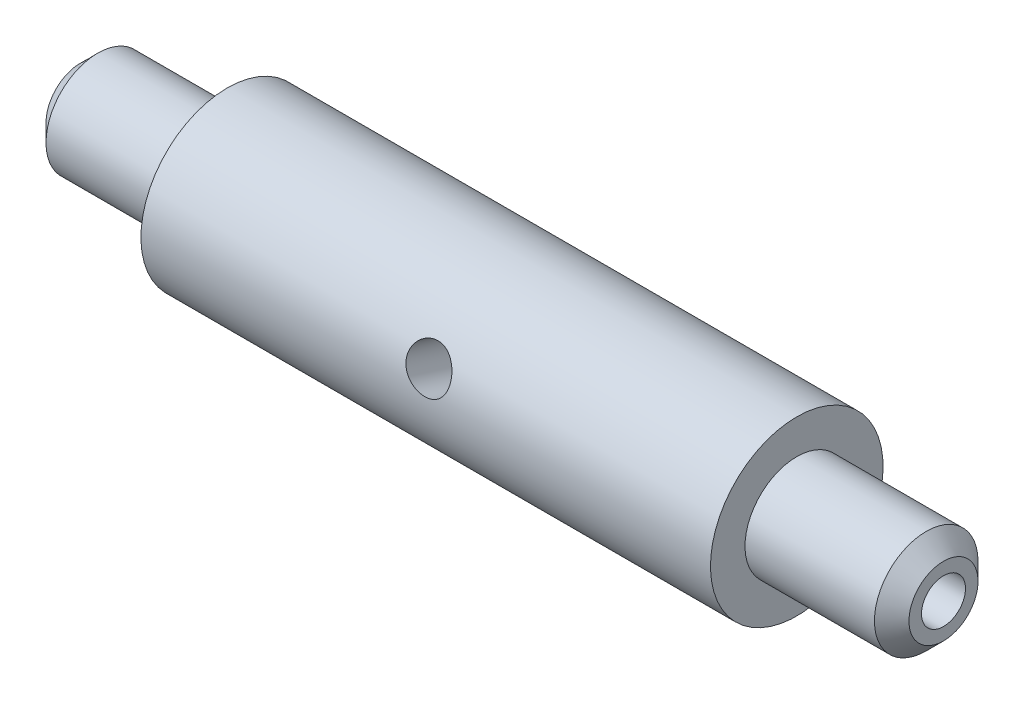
ISO-10303-21;
HEADER;
FILE_DESCRIPTION(('STEP AP214'),'2;1');
FILE_NAME('part.step','',(''),(''),'','','');
FILE_SCHEMA(('AUTOMOTIVE_DESIGN { 1 0 10303 214 1 1 1 1 }'));
ENDSEC;
DATA;
#1=APPLICATION_CONTEXT('core data for automotive mechanical design processes');
#2=APPLICATION_PROTOCOL_DEFINITION('international standard','automotive_design',2000,#1);
#3=PRODUCT_CONTEXT('',#1,'mechanical');
#4=PRODUCT('Part','Part','',(#3));
#5=PRODUCT_RELATED_PRODUCT_CATEGORY('part','',(#4));
#6=PRODUCT_DEFINITION_FORMATION('','',#4);
#7=PRODUCT_DEFINITION_CONTEXT('part definition',#1,'design');
#8=PRODUCT_DEFINITION('design','',#6,#7);
#9=PRODUCT_DEFINITION_SHAPE('','',#8);
#10=(LENGTH_UNIT() NAMED_UNIT(*) SI_UNIT(.MILLI.,.METRE.));
#11=(NAMED_UNIT(*) PLANE_ANGLE_UNIT() SI_UNIT($,.RADIAN.));
#12=(NAMED_UNIT(*) SI_UNIT($,.STERADIAN.) SOLID_ANGLE_UNIT());
#13=UNCERTAINTY_MEASURE_WITH_UNIT(LENGTH_MEASURE(1.E-05),#10,'distance_accuracy_value','');
#14=(GEOMETRIC_REPRESENTATION_CONTEXT(3) GLOBAL_UNCERTAINTY_ASSIGNED_CONTEXT((#13)) GLOBAL_UNIT_ASSIGNED_CONTEXT((#10,
#11,#12)) REPRESENTATION_CONTEXT('',''));
#15=CARTESIAN_POINT('',(0.,0.,0.));
#16=DIRECTION('',(0.,0.,1.));
#17=DIRECTION('',(1.,0.,0.));
#18=AXIS2_PLACEMENT_3D('',#15,#16,#17);
#19=CARTESIAN_POINT('',(-8.20003221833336,0.,0.));
#20=DIRECTION('',(1.,0.,0.));
#21=DIRECTION('',(0.,0.,-0.999999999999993));
#22=AXIS2_PLACEMENT_3D('',#19,#20,#21);
#23=CONICAL_SURFACE('',#22,2.54999999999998,1.02974425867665);
#24=CARTESIAN_POINT('',(-8.20003221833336,0.,0.));
#25=DIRECTION('',(1.,0.,0.));
#26=DIRECTION('',(0.,0.,-0.999999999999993));
#27=AXIS2_PLACEMENT_3D('',#24,#25,#26);
#28=CIRCLE('',#27,2.54999999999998);
#29=CARTESIAN_POINT('',(-8.2000322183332,1.37034319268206,-2.15050215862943));
#30=VERTEX_POINT('',#29);
#31=CARTESIAN_POINT('',(-8.20003221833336,2.35173390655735,0.985823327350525));
#32=VERTEX_POINT('',#31);
#33=EDGE_CURVE('E111',#30,#32,#28,.T.);
#34=ORIENTED_EDGE('',*,*,#33,.T.);
#35=CARTESIAN_POINT('',(-8.04661276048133,2.36722979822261,1.50536225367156));
#36=CARTESIAN_POINT('',(-8.06575716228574,2.36812167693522,1.44457380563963));
#37=CARTESIAN_POINT('',(-8.08458511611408,2.3680211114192,1.38367703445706));
#38=CARTESIAN_POINT('',(-8.12145272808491,2.36591071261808,1.26167566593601));
#39=CARTESIAN_POINT('',(-8.13949235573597,2.36390080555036,1.20057106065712));
#40=CARTESIAN_POINT('',(-8.19223024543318,2.35511439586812,1.01683755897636));
#41=CARTESIAN_POINT('',(-8.22550674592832,2.34557964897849,0.89391638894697));
#42=CARTESIAN_POINT('',(-8.2867348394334,2.31957752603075,0.647797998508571));
#43=CARTESIAN_POINT('',(-8.3146991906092,2.30312707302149,0.524602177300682));
#44=CARTESIAN_POINT('',(-8.36378969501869,2.26351269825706,0.277945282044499));
#45=CARTESIAN_POINT('',(-8.38491835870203,2.24035124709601,0.154484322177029));
#46=CARTESIAN_POINT('',(-8.41838591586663,2.18806767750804,-0.0893980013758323));
#47=CARTESIAN_POINT('',(-8.43091420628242,2.15909347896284,-0.209824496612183));
#48=CARTESIAN_POINT('',(-8.44685139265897,2.09506375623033,-0.449666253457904));
#49=CARTESIAN_POINT('',(-8.45026117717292,2.06000882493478,-0.569081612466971));
#50=CARTESIAN_POINT('',(-8.44763378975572,1.9840921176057,-0.805949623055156));
#51=CARTESIAN_POINT('',(-8.44159611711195,1.94323003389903,-0.923402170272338));
#52=CARTESIAN_POINT('',(-8.42064540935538,1.85602225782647,-1.15543916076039));
#53=CARTESIAN_POINT('',(-8.40573130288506,1.80967590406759,-1.27002325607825));
#54=CARTESIAN_POINT('',(-8.36913215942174,1.7140237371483,-1.49044784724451));
#55=CARTESIAN_POINT('',(-8.34778964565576,1.66495168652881,-1.59644819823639));
#56=CARTESIAN_POINT('',(-8.29946047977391,1.56216183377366,-1.80485139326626));
#57=CARTESIAN_POINT('',(-8.27247290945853,1.50844327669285,-1.90725364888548));
#58=CARTESIAN_POINT('',(-8.2141220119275,1.39628564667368,-2.10826347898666));
#59=CARTESIAN_POINT('',(-8.18275487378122,1.3378424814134,-2.20686765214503));
#60=CARTESIAN_POINT('',(-8.11681241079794,1.21609595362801,-2.39979898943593));
#61=CARTESIAN_POINT('',(-8.08223964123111,1.15279646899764,-2.49412947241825));
#62=CARTESIAN_POINT('',(-8.04661276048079,1.08693261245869,-2.58620763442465));
#63=B_SPLINE_CURVE_WITH_KNOTS('',3,(#35,#36,#37,#38,#39,#40,#41,#42,#43,#44,#45,#46,#47,#48,#49,
#50,#51,#52,#53,#54,#55,#56,#57,#58,#59,#60,#61,#62),.UNSPECIFIED.,.F.,.F.,(4,2,2,2,2,2,2,2,2,2,
2,2,2,4),(0.,0.191194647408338,0.382396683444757,0.765201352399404,1.14707468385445,
1.52880761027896,1.9018383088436,2.27483265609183,2.64784677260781,3.02090591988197,
3.37682715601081,3.73280632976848,4.08909721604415,4.44510649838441),.UNSPECIFIED.);
#64=EDGE_CURVE('E67',#32,#30,#63,.T.);
#65=ORIENTED_EDGE('',*,*,#64,.T.);
#66=EDGE_LOOP('',(#34,#65));
#67=FACE_BOUND('',#66,.T.);
#68=ADVANCED_FACE('F52',(#67),#23,.F.);
#69=CARTESIAN_POINT('',(40.2677732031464,0.,0.));
#70=DIRECTION('',(-1.,0.,0.));
#71=DIRECTION('',(0.,-0.999999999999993,0.));
#72=AXIS2_PLACEMENT_3D('',#69,#70,#71);
#73=PLANE('',#72);
#74=CARTESIAN_POINT('',(40.2677732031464,0.,0.));
#75=DIRECTION('',(1.,0.,0.));
#76=DIRECTION('',(0.,0.,-0.999999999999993));
#77=AXIS2_PLACEMENT_3D('',#74,#75,#76);
#78=CIRCLE('',#77,2.54999999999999);
#79=CARTESIAN_POINT('',(40.2677732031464,0.,-2.54999999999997));
#80=VERTEX_POINT('',#79);
#81=EDGE_CURVE('E115',#80,#80,#78,.T.);
#82=ORIENTED_EDGE('',*,*,#81,.F.);
#83=EDGE_LOOP('',(#82));
#84=FACE_BOUND('',#83,.T.);
#85=CARTESIAN_POINT('',(40.2677732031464,0.,0.));
#86=DIRECTION('',(-1.,0.,0.));
#87=DIRECTION('',(0.,-0.999999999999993,0.));
#88=AXIS2_PLACEMENT_3D('',#85,#86,#87);
#89=CIRCLE('',#88,4.00000000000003);
#90=CARTESIAN_POINT('',(40.2677732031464,-3.99999999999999,0.));
#91=VERTEX_POINT('',#90);
#92=EDGE_CURVE('E200',#91,#91,#89,.F.);
#93=ORIENTED_EDGE('',*,*,#92,.T.);
#94=EDGE_LOOP('',(#93));
#95=FACE_BOUND('',#94,.T.);
#96=ADVANCED_FACE('F172',(#84,#95),#73,.F.);
#97=CARTESIAN_POINT('',(3.28903571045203E-12,0.,0.));
#98=DIRECTION('',(1.,0.,0.));
#99=DIRECTION('',(0.,0.999999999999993,0.));
#100=AXIS2_PLACEMENT_3D('',#97,#98,#99);
#101=CYLINDRICAL_SURFACE('',#100,6.);
#102=CARTESIAN_POINT('',(38.2677732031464,0.,0.));
#103=DIRECTION('',(-1.,0.,0.));
#104=DIRECTION('',(0.,-0.999999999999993,0.));
#105=AXIS2_PLACEMENT_3D('',#102,#103,#104);
#106=CIRCLE('',#105,6.);
#107=CARTESIAN_POINT('',(38.2677732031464,-5.99999999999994,0.));
#108=VERTEX_POINT('',#107);
#109=EDGE_CURVE('E202',#108,#108,#106,.T.);
#110=ORIENTED_EDGE('',*,*,#109,.T.);
#111=EDGE_LOOP('',(#110));
#112=FACE_BOUND('',#111,.T.);
#113=CARTESIAN_POINT('',(23.2677732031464,0.,0.));
#114=DIRECTION('',(1.,0.,0.));
#115=DIRECTION('',(0.,0.999999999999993,0.));
#116=AXIS2_PLACEMENT_3D('',#113,#114,#115);
#117=CIRCLE('',#116,6.);
#118=CARTESIAN_POINT('',(23.2677732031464,5.99999999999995,0.));
#119=VERTEX_POINT('',#118);
#120=EDGE_CURVE('E191',#119,#119,#117,.T.);
#121=ORIENTED_EDGE('',*,*,#120,.T.);
#122=EDGE_LOOP('',(#121));
#123=FACE_BOUND('',#122,.T.);
#124=ADVANCED_FACE('F177',(#112,#123),#101,.T.);
#125=CARTESIAN_POINT('',(23.2677732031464,0.,0.));
#126=DIRECTION('',(1.,0.,0.));
#127=DIRECTION('',(0.,0.999999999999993,0.));
#128=AXIS2_PLACEMENT_3D('',#125,#126,#127);
#129=PLANE('',#128);
#130=CARTESIAN_POINT('',(23.2677732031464,0.,0.));
#131=DIRECTION('',(1.,0.,0.));
#132=DIRECTION('',(0.,0.999999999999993,0.));
#133=AXIS2_PLACEMENT_3D('',#130,#131,#132);
#134=CIRCLE('',#133,10.);
#135=CARTESIAN_POINT('',(23.2677732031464,9.99999999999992,0.));
#136=VERTEX_POINT('',#135);
#137=EDGE_CURVE('E188',#136,#136,#134,.T.);
#138=ORIENTED_EDGE('',*,*,#137,.T.);
#139=EDGE_LOOP('',(#138));
#140=FACE_BOUND('',#139,.T.);
#141=ORIENTED_EDGE('',*,*,#120,.F.);
#142=EDGE_LOOP('',(#141));
#143=FACE_BOUND('',#142,.T.);
#144=ADVANCED_FACE('F167',(#140,#143),#129,.T.);
#145=CARTESIAN_POINT('',(3.28903571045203E-12,0.,0.));
#146=DIRECTION('',(1.,0.,0.));
#147=DIRECTION('',(0.,0.999999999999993,0.));
#148=AXIS2_PLACEMENT_3D('',#145,#146,#147);
#149=CYLINDRICAL_SURFACE('',#148,10.);
#150=CARTESIAN_POINT('',(-9.84317442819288,0.453959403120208,9.98969072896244));
#151=CARTESIAN_POINT('',(-9.9838873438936,0.45396384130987,9.98969209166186));
#152=CARTESIAN_POINT('',(-10.1246420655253,0.466040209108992,9.98916409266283));
#153=CARTESIAN_POINT('',(-10.4021027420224,0.513866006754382,9.98681607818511));
#154=CARTESIAN_POINT('',(-10.5388063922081,0.549628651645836,9.98499534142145));
#155=CARTESIAN_POINT('',(-10.8041113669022,0.643359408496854,9.9793924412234));
#156=CARTESIAN_POINT('',(-10.9327231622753,0.701298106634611,9.97561287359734));
#157=CARTESIAN_POINT('',(-11.1786711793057,0.837304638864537,9.96511684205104));
#158=CARTESIAN_POINT('',(-11.2960068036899,0.915373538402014,9.9584002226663));
#159=CARTESIAN_POINT('',(-11.5187572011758,1.09091398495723,9.94071565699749));
#160=CARTESIAN_POINT('',(-11.6238757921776,1.18875288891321,9.92966278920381));
#161=CARTESIAN_POINT('',(-11.8165962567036,1.39973951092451,9.90212248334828));
#162=CARTESIAN_POINT('',(-11.904196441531,1.51288870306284,9.88563452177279));
#163=CARTESIAN_POINT('',(-12.0606120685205,1.75286790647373,9.84593500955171));
#164=CARTESIAN_POINT('',(-12.1291355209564,1.87987308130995,9.82262908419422));
#165=CARTESIAN_POINT('',(-12.2435523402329,2.14226448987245,9.76875701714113));
#166=CARTESIAN_POINT('',(-12.2894491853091,2.27764943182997,9.73819199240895));
#167=CARTESIAN_POINT('',(-12.3563583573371,2.54966545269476,9.67049266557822));
#168=CARTESIAN_POINT('',(-12.3778739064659,2.68621038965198,9.63351010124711));
#169=CARTESIAN_POINT('',(-12.3969903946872,2.9591032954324,9.55321534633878));
#170=CARTESIAN_POINT('',(-12.394595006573,3.09545129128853,9.50990412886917));
#171=CARTESIAN_POINT('',(-12.3663173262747,3.36078740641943,9.41935871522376));
#172=CARTESIAN_POINT('',(-12.3409783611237,3.48987275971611,9.37223812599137));
#173=CARTESIAN_POINT('',(-12.2684074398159,3.74054996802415,9.27504015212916));
#174=CARTESIAN_POINT('',(-12.2211742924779,3.86214141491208,9.22496260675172));
#175=CARTESIAN_POINT('',(-12.1057230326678,4.0959585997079,9.12356991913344));
#176=CARTESIAN_POINT('',(-12.0373136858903,4.20808662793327,9.07224759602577));
#177=CARTESIAN_POINT('',(-11.8815974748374,4.4192228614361,8.97129781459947));
#178=CARTESIAN_POINT('',(-11.7942872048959,4.51822869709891,8.92167066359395));
#179=CARTESIAN_POINT('',(-11.600343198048,4.7036543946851,8.82535391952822));
#180=CARTESIAN_POINT('',(-11.4932349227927,4.78964179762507,8.77878625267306));
#181=CARTESIAN_POINT('',(-11.2642487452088,4.94375529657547,8.6929332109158));
#182=CARTESIAN_POINT('',(-11.1423700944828,5.0118804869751,8.65364820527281));
#183=CARTESIAN_POINT('',(-10.886394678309,5.12904549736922,8.58472818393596));
#184=CARTESIAN_POINT('',(-10.7522374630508,5.17798384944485,8.55514460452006));
#185=CARTESIAN_POINT('',(-10.4760579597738,5.25502783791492,8.50803995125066));
#186=CARTESIAN_POINT('',(-10.3340374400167,5.28313813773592,8.49051617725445));
#187=CARTESIAN_POINT('',(-10.0503383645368,5.31729436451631,8.46916633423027));
#188=CARTESIAN_POINT('',(-9.90875732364,5.32392447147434,8.46497765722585));
#189=CARTESIAN_POINT('',(-9.62635270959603,5.31658639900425,8.46958842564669));
#190=CARTESIAN_POINT('',(-9.48552906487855,5.30262020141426,8.47838662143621));
#191=CARTESIAN_POINT('',(-9.21113619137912,5.25488843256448,8.50804950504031));
#192=CARTESIAN_POINT('',(-9.07748388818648,5.22146720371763,8.5287042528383));
#193=CARTESIAN_POINT('',(-8.81845806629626,5.13591702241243,8.58049187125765));
#194=CARTESIAN_POINT('',(-8.69308556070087,5.08378578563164,8.6116260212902));
#195=CARTESIAN_POINT('',(-8.45136753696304,4.96072824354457,8.68310552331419));
#196=CARTESIAN_POINT('',(-8.33525720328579,4.88944155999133,8.7236251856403));
#197=CARTESIAN_POINT('',(-8.11788697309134,4.73009172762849,8.81104274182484));
#198=CARTESIAN_POINT('',(-8.0166296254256,4.64202570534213,8.85794172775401));
#199=CARTESIAN_POINT('',(-7.82912303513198,4.4484039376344,8.95677397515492));
#200=CARTESIAN_POINT('',(-7.74333548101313,4.34245106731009,9.00880681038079));
#201=CARTESIAN_POINT('',(-7.59256589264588,4.11712955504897,9.11398259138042));
#202=CARTESIAN_POINT('',(-7.52758276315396,3.99776161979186,9.16712547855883));
#203=CARTESIAN_POINT('',(-7.42084146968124,3.74945363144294,9.27143892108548));
#204=CARTESIAN_POINT('',(-7.37891400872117,3.62059145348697,9.32262121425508));
#205=CARTESIAN_POINT('',(-7.31897058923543,3.3560094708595,9.42109878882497));
#206=CARTESIAN_POINT('',(-7.30094981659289,3.22029105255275,9.468394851));
#207=CARTESIAN_POINT('',(-7.28961123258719,2.94985091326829,9.55604637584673));
#208=CARTESIAN_POINT('',(-7.29561331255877,2.81520840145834,9.59655955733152));
#209=CARTESIAN_POINT('',(-7.33058600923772,2.54714300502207,9.67116442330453));
#210=CARTESIAN_POINT('',(-7.35955589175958,2.41372008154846,9.70525631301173));
#211=CARTESIAN_POINT('',(-7.43927107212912,2.15278253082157,9.76644249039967));
#212=CARTESIAN_POINT('',(-7.48988895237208,2.02523809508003,9.79357626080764));
#213=CARTESIAN_POINT('',(-7.61134836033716,1.77885799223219,9.84131240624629));
#214=CARTESIAN_POINT('',(-7.68219252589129,1.6600234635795,9.86191392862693));
#215=CARTESIAN_POINT('',(-7.84414308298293,1.43160305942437,9.89768764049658));
#216=CARTESIAN_POINT('',(-7.93570786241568,1.32231914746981,9.91271272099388));
#217=CARTESIAN_POINT('',(-8.1356165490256,1.11962755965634,9.93764990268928));
#218=CARTESIAN_POINT('',(-8.24396474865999,1.02622395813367,9.9475606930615));
#219=CARTESIAN_POINT('',(-8.47692295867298,0.856590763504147,9.96361737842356));
#220=CARTESIAN_POINT('',(-8.60181028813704,0.780734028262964,9.96968560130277));
#221=CARTESIAN_POINT('',(-8.86270111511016,0.651348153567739,9.97897702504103));
#222=CARTESIAN_POINT('',(-8.99869667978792,0.59780324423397,9.98220223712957));
#223=CARTESIAN_POINT('',(-9.2525114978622,0.522608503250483,9.98639159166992));
#224=CARTESIAN_POINT('',(-9.3691483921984,0.496933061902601,9.98765992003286));
#225=CARTESIAN_POINT('',(-9.6049051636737,0.462607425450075,9.98930887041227));
#226=CARTESIAN_POINT('',(-9.72402480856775,0.453955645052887,9.98968957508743));
#227=CARTESIAN_POINT('',(-9.84317442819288,0.453959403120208,9.98969072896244));
#228=B_SPLINE_CURVE_WITH_KNOTS('',3,(#150,#151,#152,#153,#154,#155,#156,#157,#158,#159,#160,
#161,#162,#163,#164,#165,#166,#167,#168,#169,#170,#171,#172,#173,#174,#175,#176,#177,#178,#179,
#180,#181,#182,#183,#184,#185,#186,#187,#188,#189,#190,#191,#192,#193,#194,#195,#196,#197,#198,
#199,#200,#201,#202,#203,#204,#205,#206,#207,#208,#209,#210,#211,#212,#213,#214,#215,#216,#217,
#218,#219,#220,#221,#222,#223,#224,#225,#226,#227),.UNSPECIFIED.,.T.,.F.,(4,2,2,2,2,2,2,2,2,2,2,
2,2,2,2,2,2,2,2,2,2,2,2,2,2,2,2,2,2,2,2,2,2,2,2,2,2,2,4),(0.,0.421701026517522,
0.843637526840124,1.26501630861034,1.6864173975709,2.11651996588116,2.54666397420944,
2.98306912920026,3.41940717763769,3.84656525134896,4.27365771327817,4.69089336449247,
5.10815171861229,5.52929388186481,5.95051199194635,6.38358065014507,6.8166712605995,
7.25202229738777,7.68727582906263,8.1105881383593,8.53385971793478,8.94985809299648,
9.36590727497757,9.79041026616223,10.2149860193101,10.6506641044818,11.0863192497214,
11.5187311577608,11.9510559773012,12.3712290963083,12.7913887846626,13.2091087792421,
13.6268832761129,14.055005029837,14.483236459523,14.9198687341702,15.3561918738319,
15.7133033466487,16.0703815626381),.UNSPECIFIED.);
#229=CARTESIAN_POINT('',(-9.84317442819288,0.453959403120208,9.98969072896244));
#230=VERTEX_POINT('',#229);
#231=EDGE_CURVE('E112',#230,#230,#228,.T.);
#232=ORIENTED_EDGE('',*,*,#231,.T.);
#233=EDGE_LOOP('',(#232));
#234=FACE_BOUND('',#233,.T.);
#235=ORIENTED_EDGE('',*,*,#137,.F.);
#236=EDGE_LOOP('',(#235));
#237=FACE_BOUND('',#236,.T.);
#238=CARTESIAN_POINT('',(-42.7322267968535,0.,0.));
#239=DIRECTION('',(1.,0.,0.));
#240=DIRECTION('',(0.,0.999999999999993,0.));
#241=AXIS2_PLACEMENT_3D('',#238,#239,#240);
#242=CIRCLE('',#241,10.);
#243=CARTESIAN_POINT('',(-42.7322267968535,9.99999999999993,0.));
#244=VERTEX_POINT('',#243);
#245=EDGE_CURVE('E183',#244,#244,#242,.T.);
#246=ORIENTED_EDGE('',*,*,#245,.T.);
#247=EDGE_LOOP('',(#246));
#248=FACE_BOUND('',#247,.T.);
#249=ADVANCED_FACE('F125',(#234,#237,#248),#149,.T.);
#250=CARTESIAN_POINT('',(-42.7322267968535,0.,0.));
#251=DIRECTION('',(1.,0.,0.));
#252=DIRECTION('',(0.,0.999999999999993,0.));
#253=AXIS2_PLACEMENT_3D('',#250,#251,#252);
#254=PLANE('',#253);
#255=ORIENTED_EDGE('',*,*,#245,.F.);
#256=EDGE_LOOP('',(#255));
#257=FACE_BOUND('',#256,.T.);
#258=CARTESIAN_POINT('',(-42.7322267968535,0.,0.));
#259=DIRECTION('',(1.,0.,0.));
#260=DIRECTION('',(0.,0.999999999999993,0.));
#261=AXIS2_PLACEMENT_3D('',#258,#259,#260);
#262=CIRCLE('',#261,5.99999999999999);
#263=CARTESIAN_POINT('',(-42.7322267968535,5.99999999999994,0.));
#264=VERTEX_POINT('',#263);
#265=EDGE_CURVE('E180',#264,#264,#262,.T.);
#266=ORIENTED_EDGE('',*,*,#265,.T.);
#267=EDGE_LOOP('',(#266));
#268=FACE_BOUND('',#267,.T.);
#269=ADVANCED_FACE('F160',(#257,#268),#254,.F.);
#270=CARTESIAN_POINT('',(3.28903571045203E-12,0.,0.));
#271=DIRECTION('',(1.,0.,0.));
#272=DIRECTION('',(0.,0.999999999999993,0.));
#273=AXIS2_PLACEMENT_3D('',#270,#271,#272);
#274=CYLINDRICAL_SURFACE('',#273,5.99999999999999);
#275=CARTESIAN_POINT('',(-57.7322267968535,0.,0.));
#276=DIRECTION('',(-1.,0.,0.));
#277=DIRECTION('',(0.,-0.999999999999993,0.));
#278=AXIS2_PLACEMENT_3D('',#275,#276,#277);
#279=CIRCLE('',#278,5.99999999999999);
#280=CARTESIAN_POINT('',(-57.7322267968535,-5.99999999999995,0.));
#281=VERTEX_POINT('',#280);
#282=EDGE_CURVE('E194',#281,#281,#279,.F.);
#283=ORIENTED_EDGE('',*,*,#282,.T.);
#284=EDGE_LOOP('',(#283));
#285=FACE_BOUND('',#284,.T.);
#286=ORIENTED_EDGE('',*,*,#265,.F.);
#287=EDGE_LOOP('',(#286));
#288=FACE_BOUND('',#287,.T.);
#289=ADVANCED_FACE('F157',(#285,#288),#274,.T.);
#290=CARTESIAN_POINT('',(-59.7322267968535,0.,0.));
#291=DIRECTION('',(-1.,0.,0.));
#292=DIRECTION('',(0.,-0.999999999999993,0.));
#293=AXIS2_PLACEMENT_3D('',#290,#291,#292);
#294=PLANE('',#293);
#295=CARTESIAN_POINT('',(-59.7322267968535,0.,0.));
#296=DIRECTION('',(-1.,0.,0.));
#297=DIRECTION('',(0.,-0.999999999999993,0.));
#298=AXIS2_PLACEMENT_3D('',#295,#296,#297);
#299=CIRCLE('',#298,3.99999999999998);
#300=CARTESIAN_POINT('',(-59.7322267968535,-3.99999999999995,0.));
#301=VERTEX_POINT('',#300);
#302=EDGE_CURVE('E197',#301,#301,#299,.T.);
#303=ORIENTED_EDGE('',*,*,#302,.T.);
#304=EDGE_LOOP('',(#303));
#305=FACE_BOUND('',#304,.T.);
#306=ADVANCED_FACE('F152',(#305),#294,.T.);
#307=CARTESIAN_POINT('',(-57.7322267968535,0.,0.));
#308=DIRECTION('',(1.,0.,0.));
#309=DIRECTION('',(0.,0.999999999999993,0.));
#310=AXIS2_PLACEMENT_3D('',#307,#308,#309);
#311=CONICAL_SURFACE('',#310,5.99999999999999,0.785398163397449);
#312=ORIENTED_EDGE('',*,*,#302,.F.);
#313=EDGE_LOOP('',(#312));
#314=FACE_BOUND('',#313,.T.);
#315=ORIENTED_EDGE('',*,*,#282,.F.);
#316=EDGE_LOOP('',(#315));
#317=FACE_BOUND('',#316,.T.);
#318=ADVANCED_FACE('F156',(#314,#317),#311,.T.);
#319=CARTESIAN_POINT('',(40.2677732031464,0.,0.));
#320=DIRECTION('',(-1.,0.,0.));
#321=DIRECTION('',(0.,-0.999999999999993,0.));
#322=AXIS2_PLACEMENT_3D('',#319,#320,#321);
#323=CONICAL_SURFACE('',#322,4.00000000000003,0.785398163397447);
#324=ORIENTED_EDGE('',*,*,#109,.F.);
#325=EDGE_LOOP('',(#324));
#326=FACE_BOUND('',#325,.T.);
#327=ORIENTED_EDGE('',*,*,#92,.F.);
#328=EDGE_LOOP('',(#327));
#329=FACE_BOUND('',#328,.T.);
#330=ADVANCED_FACE('F55',(#326,#329),#323,.T.);
#331=CARTESIAN_POINT('',(-8.20003221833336,-1.3703431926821,2.1505021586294));
#332=VERTEX_POINT('',#331);
#333=CARTESIAN_POINT('',(-8.20003221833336,-2.35173390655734,-0.985823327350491));
#334=VERTEX_POINT('',#333);
#335=EDGE_CURVE('E181',#332,#334,#28,.T.);
#336=ORIENTED_EDGE('',*,*,#335,.T.);
#337=CARTESIAN_POINT('',(-8.04661276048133,-2.36722979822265,-1.50536225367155));
#338=CARTESIAN_POINT('',(-8.06575716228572,-2.36812167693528,-1.44457380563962));
#339=CARTESIAN_POINT('',(-8.08458511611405,-2.36802111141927,-1.38367703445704));
#340=CARTESIAN_POINT('',(-8.12145272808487,-2.36591071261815,-1.26167566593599));
#341=CARTESIAN_POINT('',(-8.13949235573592,-2.36390080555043,-1.2005710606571));
#342=CARTESIAN_POINT('',(-8.19223024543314,-2.35511439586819,-1.01683755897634));
#343=CARTESIAN_POINT('',(-8.22550674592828,-2.34557964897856,-0.893916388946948));
#344=CARTESIAN_POINT('',(-8.28673483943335,-2.31957752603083,-0.647797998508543));
#345=CARTESIAN_POINT('',(-8.31469919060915,-2.30312707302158,-0.52460217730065));
#346=CARTESIAN_POINT('',(-8.36378969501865,-2.26351269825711,-0.277945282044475));
#347=CARTESIAN_POINT('',(-8.38491835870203,-2.24035124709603,-0.154484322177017));
#348=CARTESIAN_POINT('',(-8.41838591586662,-2.18806767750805,0.0893980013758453));
#349=CARTESIAN_POINT('',(-8.43091420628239,-2.1590934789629,0.209824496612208));
#350=CARTESIAN_POINT('',(-8.44685139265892,-2.09506375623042,0.449666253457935));
#351=CARTESIAN_POINT('',(-8.45026117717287,-2.06000882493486,0.569081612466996));
#352=CARTESIAN_POINT('',(-8.44763378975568,-1.98409211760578,0.805949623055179));
#353=CARTESIAN_POINT('',(-8.4415961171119,-1.94323003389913,0.923402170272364));
#354=CARTESIAN_POINT('',(-8.42064540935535,-1.85602225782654,1.15543916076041));
#355=CARTESIAN_POINT('',(-8.40573130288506,-1.80967590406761,1.27002325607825));
#356=CARTESIAN_POINT('',(-8.36913215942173,-1.71402373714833,1.4904478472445));
#357=CARTESIAN_POINT('',(-8.34778964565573,-1.66495168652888,1.5964481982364));
#358=CARTESIAN_POINT('',(-8.29946047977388,-1.56216183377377,1.80485139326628));
#359=CARTESIAN_POINT('',(-8.27247290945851,-1.50844327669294,1.90725364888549));
#360=CARTESIAN_POINT('',(-8.21412201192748,-1.39628564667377,2.10826347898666));
#361=CARTESIAN_POINT('',(-8.18275487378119,-1.3378424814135,2.20686765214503));
#362=CARTESIAN_POINT('',(-8.11681241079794,-1.2160959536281,2.39979898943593));
#363=CARTESIAN_POINT('',(-8.08223964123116,-1.15279646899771,2.49412947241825));
#364=CARTESIAN_POINT('',(-8.04661276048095,-1.08693261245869,2.58620763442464));
#365=B_SPLINE_CURVE_WITH_KNOTS('',3,(#337,#338,#339,#340,#341,#342,#343,#344,#345,#346,#347,
#348,#349,#350,#351,#352,#353,#354,#355,#356,#357,#358,#359,#360,#361,#362,#363,#364),
.UNSPECIFIED.,.F.,.F.,(4,2,2,2,2,2,2,2,2,2,2,2,2,4),(0.,0.19119464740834,0.382396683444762,
0.765201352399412,1.14707468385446,1.52880761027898,1.90183830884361,2.27483265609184,
2.64784677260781,3.02090591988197,3.37682715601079,3.73280632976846,4.08909721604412,
4.44510649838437),.UNSPECIFIED.);
#366=EDGE_CURVE('E135',#334,#332,#365,.T.);
#367=ORIENTED_EDGE('',*,*,#366,.T.);
#368=EDGE_LOOP('',(#336,#367));
#369=FACE_BOUND('',#368,.T.);
#370=ADVANCED_FACE('F146',(#369),#23,.F.);
#371=CARTESIAN_POINT('',(40.2677732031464,0.,0.));
#372=DIRECTION('',(1.,0.,0.));
#373=DIRECTION('',(0.,0.,-0.999999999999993));
#374=AXIS2_PLACEMENT_3D('',#371,#372,#373);
#375=CYLINDRICAL_SURFACE('',#374,2.54999999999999);
#376=ORIENTED_EDGE('',*,*,#335,.F.);
#377=CARTESIAN_POINT('',(-9.84317442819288,0.,0.));
#378=DIRECTION('',(0.707106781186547,-0.211164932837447,-0.674840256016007));
#379=DIRECTION('',(0.707106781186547,0.211164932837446,0.674840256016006));
#380=AXIS2_PLACEMENT_3D('',#377,#378,#379);
#381=ELLIPSE('',#380,3.60624458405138,2.54999999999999);
#382=EDGE_CURVE('E74',#332,#32,#381,.F.);
#383=ORIENTED_EDGE('',*,*,#382,.T.);
#384=ORIENTED_EDGE('',*,*,#33,.F.);
#385=CARTESIAN_POINT('',(-9.84317442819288,0.,0.));
#386=DIRECTION('',(0.707106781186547,0.211164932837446,0.674840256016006));
#387=DIRECTION('',(0.707106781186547,-0.211164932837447,-0.674840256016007));
#388=AXIS2_PLACEMENT_3D('',#385,#386,#387);
#389=ELLIPSE('',#388,3.60624458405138,2.54999999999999);
#390=CARTESIAN_POINT('',(-7.37536900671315,-0.124059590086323,-2.54698041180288));
#391=VERTEX_POINT('',#390);
#392=EDGE_CURVE('E80',#30,#391,#389,.F.);
#393=ORIENTED_EDGE('',*,*,#392,.T.);
#394=CARTESIAN_POINT('',(-7.20228864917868,0.445266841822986,-2.51082405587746));
#395=CARTESIAN_POINT('',(-7.22415507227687,0.396885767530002,-2.51941700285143));
#396=CARTESIAN_POINT('',(-7.24425952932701,0.347486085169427,-2.52672218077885));
#397=CARTESIAN_POINT('',(-7.28100981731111,0.24712723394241,-2.53849598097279));
#398=CARTESIAN_POINT('',(-7.29765807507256,0.196169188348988,-2.54296659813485));
#399=CARTESIAN_POINT('',(-7.32750672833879,0.0933950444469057,-2.54880643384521));
#400=CARTESIAN_POINT('',(-7.34072619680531,0.0415854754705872,-2.55019314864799));
#401=CARTESIAN_POINT('',(-7.36408296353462,-0.0627023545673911,-2.54976313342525));
#402=CARTESIAN_POINT('',(-7.37421988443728,-0.115180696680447,-2.54794601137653));
#403=CARTESIAN_POINT('',(-7.40041768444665,-0.272675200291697,-2.53755114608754));
#404=CARTESIAN_POINT('',(-7.41236133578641,-0.378099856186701,-2.52405094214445));
#405=CARTESIAN_POINT('',(-7.42750405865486,-0.587221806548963,-2.48375838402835));
#406=CARTESIAN_POINT('',(-7.43068217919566,-0.69091437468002,-2.45693436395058));
#407=CARTESIAN_POINT('',(-7.42937664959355,-0.848959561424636,-2.4052680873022));
#408=CARTESIAN_POINT('',(-7.42766381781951,-0.904817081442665,-2.38481370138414));
#409=CARTESIAN_POINT('',(-7.42158846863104,-1.01486436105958,-2.34010144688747));
#410=CARTESIAN_POINT('',(-7.41722555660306,-1.06905387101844,-2.31584301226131));
#411=CARTESIAN_POINT('',(-7.40557445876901,-1.17523331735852,-2.26380490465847));
#412=CARTESIAN_POINT('',(-7.3982932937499,-1.22722820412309,-2.2360337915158));
#413=CARTESIAN_POINT('',(-7.38040798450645,-1.32874869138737,-2.17723960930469));
#414=CARTESIAN_POINT('',(-7.36980355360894,-1.37827407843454,-2.14621625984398));
#415=CARTESIAN_POINT('',(-7.33959681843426,-1.49457220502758,-2.06772827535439));
#416=CARTESIAN_POINT('',(-7.31808627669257,-1.5599055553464,-2.01880994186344));
#417=CARTESIAN_POINT('',(-7.27949268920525,-1.65275675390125,-1.94229782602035));
#418=CARTESIAN_POINT('',(-7.26554628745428,-1.6828928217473,-1.91622738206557));
#419=CARTESIAN_POINT('',(-7.23552097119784,-1.74135013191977,-1.86326467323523));
#420=CARTESIAN_POINT('',(-7.21944118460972,-1.7696706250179,-1.83637207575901));
#421=CARTESIAN_POINT('',(-7.20228864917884,-1.7970437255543,-1.80918043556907));
#422=B_SPLINE_CURVE_WITH_KNOTS('',3,(#394,#395,#396,#397,#398,#399,#400,#401,#402,#403,#404,
#405,#406,#407,#408,#409,#410,#411,#412,#413,#414,#415,#416,#417,#418,#419,#420,#421),
.UNSPECIFIED.,.F.,.F.,(4,2,2,2,2,2,2,2,2,2,2,2,2,4),(0.,0.16129026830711,0.322466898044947,
0.48272674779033,0.643006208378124,0.962490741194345,1.28273823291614,1.46109249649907,
1.63947332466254,1.81742755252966,1.99539713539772,2.24772490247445,2.37429200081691,
2.50091099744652),.UNSPECIFIED.);
#423=CARTESIAN_POINT('',(-7.37536900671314,-1.34987328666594,-2.16340983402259));
#424=VERTEX_POINT('',#423);
#425=EDGE_CURVE('E13',#391,#424,#422,.T.);
#426=ORIENTED_EDGE('',*,*,#425,.T.);
#427=EDGE_CURVE('E107',#424,#334,#389,.F.);
#428=ORIENTED_EDGE('',*,*,#427,.T.);
#429=EDGE_LOOP('',(#376,#383,#384,#393,#426,#428));
#430=FACE_BOUND('',#429,.T.);
#431=ORIENTED_EDGE('',*,*,#81,.T.);
#432=EDGE_LOOP('',(#431));
#433=FACE_BOUND('',#432,.T.);
#434=ADVANCED_FACE('F99',(#430,#433),#375,.F.);
#435=CARTESIAN_POINT('',(-9.84317442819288,-0.736966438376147,-2.35519512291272));
#436=DIRECTION('',(0.,0.298632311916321,0.954368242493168));
#437=DIRECTION('',(0.,-0.954368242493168,0.298632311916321));
#438=AXIS2_PLACEMENT_3D('',#435,#436,#437);
#439=CONICAL_SURFACE('',#438,2.55,1.02974425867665);
#440=CARTESIAN_POINT('',(-9.84317442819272,-1.19452924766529,-3.81747296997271));
#441=VERTEX_POINT('',#440);
#442=VERTEX_LOOP('',#441);
#443=FACE_BOUND('',#442,.T.);
#444=CARTESIAN_POINT('',(-9.84317442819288,-0.736966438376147,-2.35519512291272));
#445=DIRECTION('',(0.,0.298632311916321,0.954368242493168));
#446=DIRECTION('',(0.,-0.954368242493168,0.298632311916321));
#447=AXIS2_PLACEMENT_3D('',#444,#445,#446);
#448=CIRCLE('',#447,2.55);
#449=EDGE_CURVE('E101',#391,#424,#448,.T.);
#450=ORIENTED_EDGE('',*,*,#449,.T.);
#451=ORIENTED_EDGE('',*,*,#425,.F.);
#452=EDGE_LOOP('',(#450,#451));
#453=FACE_BOUND('',#452,.T.);
#454=ADVANCED_FACE('F95',(#443,#453),#439,.F.);
#455=CARTESIAN_POINT('',(-9.84317442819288,2.98632311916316,9.54368242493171));
#456=DIRECTION('',(0.,0.298632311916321,0.954368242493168));
#457=DIRECTION('',(0.,-0.954368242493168,0.298632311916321));
#458=AXIS2_PLACEMENT_3D('',#455,#456,#457);
#459=CYLINDRICAL_SURFACE('',#458,2.54999999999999);
#460=ORIENTED_EDGE('',*,*,#64,.F.);
#461=ORIENTED_EDGE('',*,*,#382,.F.);
#462=ORIENTED_EDGE('',*,*,#366,.F.);
#463=ORIENTED_EDGE('',*,*,#427,.F.);
#464=ORIENTED_EDGE('',*,*,#449,.F.);
#465=ORIENTED_EDGE('',*,*,#392,.F.);
#466=EDGE_LOOP('',(#460,#461,#462,#463,#464,#465));
#467=FACE_BOUND('',#466,.T.);
#468=ORIENTED_EDGE('',*,*,#231,.F.);
#469=EDGE_LOOP('',(#468));
#470=FACE_BOUND('',#469,.T.);
#471=ADVANCED_FACE('F98',(#467,#470),#459,.F.);
#472=CLOSED_SHELL('',(#68,#96,#124,#144,#249,#269,#289,#306,#318,#330,#370,#434,#454,#471));
#473=MANIFOLD_SOLID_BREP('B2',#472);
#474=ADVANCED_BREP_SHAPE_REPRESENTATION('',(#18,#473),#14);
#475=SHAPE_DEFINITION_REPRESENTATION(#9,#474);
ENDSEC;
END-ISO-10303-21;
